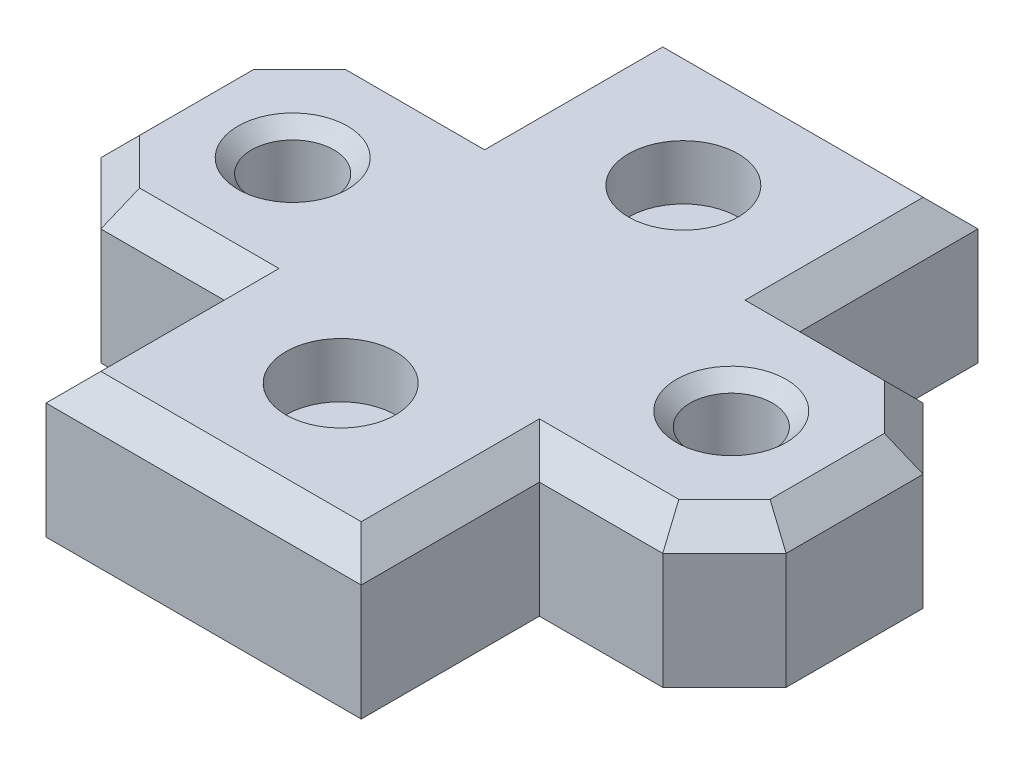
from build123d import *

# Parameters (mm, degrees)
LINEAR_AUSTRAGEN1_DEPTH = 10.47
FASE1_SIZE              = 2
SKIZZE2_R               = 3
LINEAR_AUSTRAGEN2_DEPTH = 36.225997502
FASE2_SIZE              = 1
SKIZZE3_R               = 4
LINEAR_AUSTRAGEN3_DEPTH = 4


with BuildPart() as part:
    # Skizze1 → Linear austragen1 (new body)
    with BuildSketch(Plane(origin=(0, 0, 0), x_dir=(1, 0, 0), z_dir=(0, 1, 0))):
        Polygon((11.5, 22.5), (-11.5, 22.5), (-11.5, 9.5), (-20.5, 9.5), (-25, 5), (-25, -5), (-20.5, -9.5), (-11.5, -9.5), (-11.5, -22.5), (11.5, -22.5), (11.5, -9.5), (20.5, -9.5), (25, -5), (25, 5), (20.5, 9.5), (11.5, 9.5), align=None)
    extrude(amount=LINEAR_AUSTRAGEN1_DEPTH)

    # Fase1
    fase1_edges = [part.edges().sort_by_distance(p)[0] for p in [
        (0, 10.47, -22.5),
        (-11.5, 10.47, -16),
        (-16, 10.47, -9.5),
        (-22.75, 10.47, -7.25),
        (-25, 10.47, 0),
        (-22.75, 10.47, 7.25),
        (-16, 10.47, 9.5),
        (-11.5, 10.47, 16),
        (0, 10.47, 22.5),
        (11.5, 10.47, 16),
        (16, 10.47, -9.5),
        (16, 10.47, 9.5),
        (22.75, 10.47, 7.25),
        (25, 10.47, 0),
        (22.75, 10.47, -7.25),
        (11.5, 10.47, -16),
    ]]
    chamfer(fase1_edges, length=FASE1_SIZE)

    # Skizze2 → Linear austragen2 (cut, through all)
    with BuildSketch(Plane(origin=(0, 10.47, 0), x_dir=(1, 0, 0), z_dir=(0, 1, 0))):
        with Locations(Location((16, 0, 0), (0, 0, 270))):
            Circle(SKIZZE2_R)
        with Locations(Location((-16, 0, 0), (0, 0, 270))):
            Circle(SKIZZE2_R)
    extrude(amount=-LINEAR_AUSTRAGEN2_DEPTH, mode=Mode.SUBTRACT)

    # Fase2
    fase2_edges = [part.edges().sort_by_distance(p)[0] for p in [
        (16, 10.47, -3),
        (-16, 10.47, -3),
    ]]
    chamfer(fase2_edges, length=FASE2_SIZE)

    # Skizze3 → Linear austragen3 (cut)
    with BuildSketch(Plane(origin=(0, 10.47, 0), x_dir=(1, 0, 0), z_dir=(0, 1, 0))):
        with Locations(Location((0, -12.5, 0), (0, 0, 270))):
            Circle(SKIZZE3_R)
        with Locations(Location((0, 12.5, 0), (0, 0, 270))):
            Circle(SKIZZE3_R)
    extrude(amount=-LINEAR_AUSTRAGEN3_DEPTH, mode=Mode.SUBTRACT)


solid = part.part
